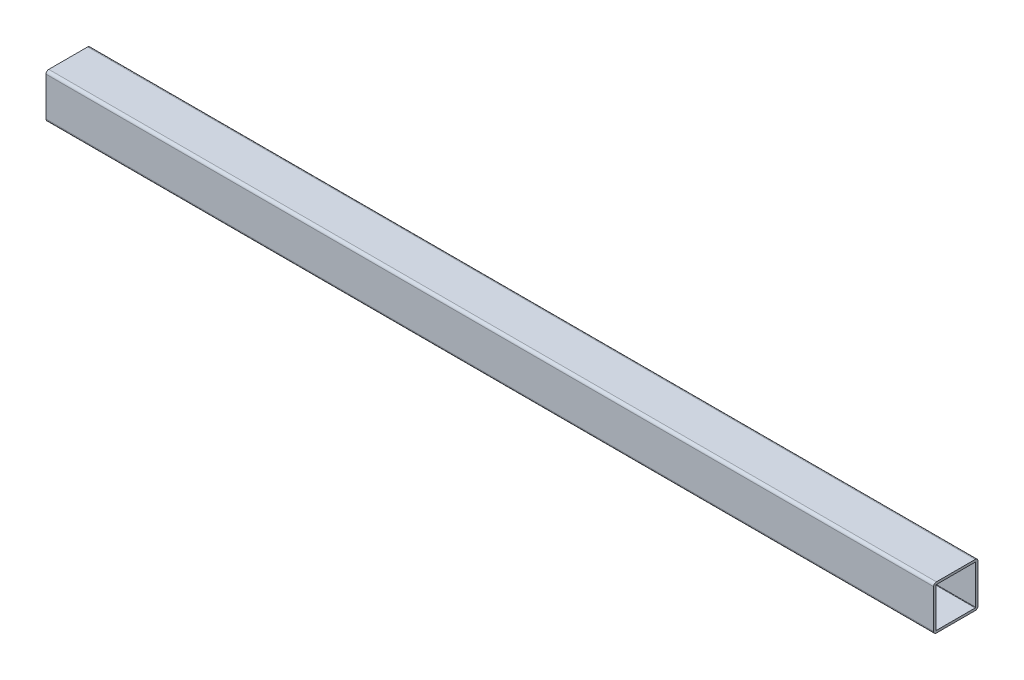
ISO-10303-21;
HEADER;
FILE_DESCRIPTION(('STEP AP214'),'2;1');
FILE_NAME('part.step','',(''),(''),'','','');
FILE_SCHEMA(('AUTOMOTIVE_DESIGN { 1 0 10303 214 1 1 1 1 }'));
ENDSEC;
DATA;
#1=APPLICATION_CONTEXT('core data for automotive mechanical design processes');
#2=APPLICATION_PROTOCOL_DEFINITION('international standard','automotive_design',2000,#1);
#3=PRODUCT_CONTEXT('',#1,'mechanical');
#4=PRODUCT('Part','Part','',(#3));
#5=PRODUCT_RELATED_PRODUCT_CATEGORY('part','',(#4));
#6=PRODUCT_DEFINITION_FORMATION('','',#4);
#7=PRODUCT_DEFINITION_CONTEXT('part definition',#1,'design');
#8=PRODUCT_DEFINITION('design','',#6,#7);
#9=PRODUCT_DEFINITION_SHAPE('','',#8);
#10=(LENGTH_UNIT() NAMED_UNIT(*) SI_UNIT(.MILLI.,.METRE.));
#11=(NAMED_UNIT(*) PLANE_ANGLE_UNIT() SI_UNIT($,.RADIAN.));
#12=(NAMED_UNIT(*) SI_UNIT($,.STERADIAN.) SOLID_ANGLE_UNIT());
#13=UNCERTAINTY_MEASURE_WITH_UNIT(LENGTH_MEASURE(1.E-05),#10,'distance_accuracy_value','');
#14=(GEOMETRIC_REPRESENTATION_CONTEXT(3) GLOBAL_UNCERTAINTY_ASSIGNED_CONTEXT((#13)) GLOBAL_UNIT_ASSIGNED_CONTEXT((#10,
#11,#12)) REPRESENTATION_CONTEXT('',''));
#15=CARTESIAN_POINT('',(0.,0.,0.));
#16=DIRECTION('',(0.,0.,1.));
#17=DIRECTION('',(1.,0.,0.));
#18=AXIS2_PLACEMENT_3D('',#15,#16,#17);
#19=CARTESIAN_POINT('',(508.,3.65674086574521,-16.8519621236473));
#20=DIRECTION('',(-1.,0.,0.));
#21=DIRECTION('',(0.,0.,1.));
#22=AXIS2_PLACEMENT_3D('',#19,#20,#21);
#23=PLANE('',#22);
#24=CARTESIAN_POINT('',(508.,3.65674086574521,-16.8519621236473));
#25=DIRECTION('',(1.,0.,0.));
#26=DIRECTION('',(0.,0.,1.));
#27=AXIS2_PLACEMENT_3D('',#24,#25,#26);
#28=CIRCLE('',#27,1.5875);
#29=CARTESIAN_POINT('',(508.,3.6567408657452,-18.4394621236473));
#30=VERTEX_POINT('',#29);
#31=CARTESIAN_POINT('',(508.,5.24424086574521,-16.8519621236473));
#32=VERTEX_POINT('',#31);
#33=EDGE_CURVE('E211',#30,#32,#28,.T.);
#34=ORIENTED_EDGE('',*,*,#33,.T.);
#35=DIRECTION('',(0.,0.,1.));
#36=VECTOR('',#35,1.);
#37=CARTESIAN_POINT('',(508.,5.24424086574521,5.37303787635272));
#38=LINE('',#37,#36);
#39=CARTESIAN_POINT('',(508.,5.24424086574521,5.37303787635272));
#40=VERTEX_POINT('',#39);
#41=EDGE_CURVE('E214',#32,#40,#38,.T.);
#42=ORIENTED_EDGE('',*,*,#41,.T.);
#43=CARTESIAN_POINT('',(508.,3.65674086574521,5.37303787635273));
#44=DIRECTION('',(1.,0.,0.));
#45=DIRECTION('',(0.,0.,1.));
#46=AXIS2_PLACEMENT_3D('',#43,#44,#45);
#47=CIRCLE('',#46,1.5875);
#48=CARTESIAN_POINT('',(508.,3.6567408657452,6.96053787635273));
#49=VERTEX_POINT('',#48);
#50=EDGE_CURVE('E217',#40,#49,#47,.T.);
#51=ORIENTED_EDGE('',*,*,#50,.T.);
#52=DIRECTION('',(0.,-1.,0.));
#53=VECTOR('',#52,1.);
#54=CARTESIAN_POINT('',(508.,3.6567408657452,6.96053787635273));
#55=LINE('',#54,#53);
#56=CARTESIAN_POINT('',(508.,-18.5682591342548,6.96053787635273));
#57=VERTEX_POINT('',#56);
#58=EDGE_CURVE('E219',#49,#57,#55,.T.);
#59=ORIENTED_EDGE('',*,*,#58,.T.);
#60=CARTESIAN_POINT('',(508.,-18.5682591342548,5.37303787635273));
#61=DIRECTION('',(1.,0.,0.));
#62=DIRECTION('',(0.,0.,1.));
#63=AXIS2_PLACEMENT_3D('',#60,#61,#62);
#64=CIRCLE('',#63,1.5875);
#65=CARTESIAN_POINT('',(508.,-20.1557591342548,5.37303787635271));
#66=VERTEX_POINT('',#65);
#67=EDGE_CURVE('E221',#57,#66,#64,.T.);
#68=ORIENTED_EDGE('',*,*,#67,.T.);
#69=DIRECTION('',(0.,0.,-1.));
#70=VECTOR('',#69,1.);
#71=CARTESIAN_POINT('',(508.,-20.1557591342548,5.37303787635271));
#72=LINE('',#71,#70);
#73=CARTESIAN_POINT('',(508.,-20.1557591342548,-16.8519621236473));
#74=VERTEX_POINT('',#73);
#75=EDGE_CURVE('E223',#66,#74,#72,.T.);
#76=ORIENTED_EDGE('',*,*,#75,.T.);
#77=CARTESIAN_POINT('',(508.,-18.5682591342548,-16.8519621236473));
#78=DIRECTION('',(1.,0.,0.));
#79=DIRECTION('',(0.,0.,1.));
#80=AXIS2_PLACEMENT_3D('',#77,#78,#79);
#81=CIRCLE('',#80,1.5875);
#82=CARTESIAN_POINT('',(508.,-18.5682591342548,-18.4394621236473));
#83=VERTEX_POINT('',#82);
#84=EDGE_CURVE('E225',#74,#83,#81,.T.);
#85=ORIENTED_EDGE('',*,*,#84,.T.);
#86=DIRECTION('',(0.,1.,0.));
#87=VECTOR('',#86,1.);
#88=CARTESIAN_POINT('',(508.,3.6567408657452,-18.4394621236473));
#89=LINE('',#88,#87);
#90=EDGE_CURVE('E227',#83,#30,#89,.T.);
#91=ORIENTED_EDGE('',*,*,#90,.T.);
#92=EDGE_LOOP('',(#34,#42,#51,#59,#68,#76,#85,#91));
#93=FACE_BOUND('',#92,.T.);
#94=CARTESIAN_POINT('',(508.,3.65674086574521,5.37303787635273));
#95=DIRECTION('',(1.,0.,0.));
#96=DIRECTION('',(0.,0.,1.));
#97=AXIS2_PLACEMENT_3D('',#94,#95,#96);
#98=CIRCLE('',#97,0.2413);
#99=CARTESIAN_POINT('',(508.,3.89804086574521,5.37303787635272));
#100=VERTEX_POINT('',#99);
#101=CARTESIAN_POINT('',(508.,3.6567408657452,5.61433787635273));
#102=VERTEX_POINT('',#101);
#103=EDGE_CURVE('E146',#100,#102,#98,.T.);
#104=ORIENTED_EDGE('',*,*,#103,.F.);
#105=DIRECTION('',(0.,0.,1.));
#106=VECTOR('',#105,1.);
#107=CARTESIAN_POINT('',(508.,3.89804086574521,5.37303787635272));
#108=LINE('',#107,#106);
#109=CARTESIAN_POINT('',(508.,3.89804086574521,-16.8519621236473));
#110=VERTEX_POINT('',#109);
#111=EDGE_CURVE('E179',#110,#100,#108,.T.);
#112=ORIENTED_EDGE('',*,*,#111,.F.);
#113=CARTESIAN_POINT('',(508.,3.65674086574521,-16.8519621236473));
#114=DIRECTION('',(1.,0.,0.));
#115=DIRECTION('',(0.,0.,1.));
#116=AXIS2_PLACEMENT_3D('',#113,#114,#115);
#117=CIRCLE('',#116,0.2413);
#118=CARTESIAN_POINT('',(508.,3.65674086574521,-17.0932621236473));
#119=VERTEX_POINT('',#118);
#120=EDGE_CURVE('E177',#119,#110,#117,.T.);
#121=ORIENTED_EDGE('',*,*,#120,.F.);
#122=DIRECTION('',(0.,1.,0.));
#123=VECTOR('',#122,1.);
#124=CARTESIAN_POINT('',(508.,3.65674086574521,-17.0932621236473));
#125=LINE('',#124,#123);
#126=CARTESIAN_POINT('',(508.,-18.5682591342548,-17.0932621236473));
#127=VERTEX_POINT('',#126);
#128=EDGE_CURVE('E175',#127,#119,#125,.T.);
#129=ORIENTED_EDGE('',*,*,#128,.F.);
#130=CARTESIAN_POINT('',(508.,-18.5682591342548,-16.8519621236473));
#131=DIRECTION('',(1.,0.,0.));
#132=DIRECTION('',(0.,0.,1.));
#133=AXIS2_PLACEMENT_3D('',#130,#131,#132);
#134=CIRCLE('',#133,0.241299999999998);
#135=CARTESIAN_POINT('',(508.,-18.8095591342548,-16.8519621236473));
#136=VERTEX_POINT('',#135);
#137=EDGE_CURVE('E173',#136,#127,#134,.T.);
#138=ORIENTED_EDGE('',*,*,#137,.F.);
#139=DIRECTION('',(0.,0.,-1.));
#140=VECTOR('',#139,1.);
#141=CARTESIAN_POINT('',(508.,-18.8095591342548,5.37303787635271));
#142=LINE('',#141,#140);
#143=CARTESIAN_POINT('',(508.,-18.8095591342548,5.37303787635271));
#144=VERTEX_POINT('',#143);
#145=EDGE_CURVE('E169',#144,#136,#142,.T.);
#146=ORIENTED_EDGE('',*,*,#145,.F.);
#147=CARTESIAN_POINT('',(508.,-18.5682591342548,5.37303787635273));
#148=DIRECTION('',(1.,0.,0.));
#149=DIRECTION('',(0.,0.,1.));
#150=AXIS2_PLACEMENT_3D('',#147,#148,#149);
#151=CIRCLE('',#150,0.241299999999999);
#152=CARTESIAN_POINT('',(508.,-18.5682591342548,5.61433787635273));
#153=VERTEX_POINT('',#152);
#154=EDGE_CURVE('E167',#153,#144,#151,.T.);
#155=ORIENTED_EDGE('',*,*,#154,.F.);
#156=DIRECTION('',(0.,-1.,0.));
#157=VECTOR('',#156,1.);
#158=CARTESIAN_POINT('',(508.,3.6567408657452,5.61433787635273));
#159=LINE('',#158,#157);
#160=EDGE_CURVE('E154',#102,#153,#159,.T.);
#161=ORIENTED_EDGE('',*,*,#160,.F.);
#162=EDGE_LOOP('',(#104,#112,#121,#129,#138,#146,#155,#161));
#163=FACE_BOUND('',#162,.T.);
#164=ADVANCED_FACE('F33',(#93,#163),#23,.F.);
#165=CARTESIAN_POINT('',(0.,3.65674086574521,-16.8519621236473));
#166=DIRECTION('',(-1.,0.,0.));
#167=DIRECTION('',(0.,0.,1.));
#168=AXIS2_PLACEMENT_3D('',#165,#166,#167);
#169=PLANE('',#168);
#170=CARTESIAN_POINT('',(0.,3.65674086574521,-16.8519621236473));
#171=DIRECTION('',(1.,0.,0.));
#172=DIRECTION('',(0.,0.,1.));
#173=AXIS2_PLACEMENT_3D('',#170,#171,#172);
#174=CIRCLE('',#173,1.5875);
#175=CARTESIAN_POINT('',(0.,3.6567408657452,-18.4394621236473));
#176=VERTEX_POINT('',#175);
#177=CARTESIAN_POINT('',(0.,5.24424086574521,-16.8519621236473));
#178=VERTEX_POINT('',#177);
#179=EDGE_CURVE('E162',#176,#178,#174,.T.);
#180=ORIENTED_EDGE('',*,*,#179,.F.);
#181=DIRECTION('',(0.,1.,0.));
#182=VECTOR('',#181,1.);
#183=CARTESIAN_POINT('',(0.,3.6567408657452,-18.4394621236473));
#184=LINE('',#183,#182);
#185=CARTESIAN_POINT('',(0.,-18.5682591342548,-18.4394621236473));
#186=VERTEX_POINT('',#185);
#187=EDGE_CURVE('E215',#186,#176,#184,.T.);
#188=ORIENTED_EDGE('',*,*,#187,.F.);
#189=CARTESIAN_POINT('',(0.,-18.5682591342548,-16.8519621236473));
#190=DIRECTION('',(1.,0.,0.));
#191=DIRECTION('',(0.,0.,1.));
#192=AXIS2_PLACEMENT_3D('',#189,#190,#191);
#193=CIRCLE('',#192,1.5875);
#194=CARTESIAN_POINT('',(0.,-20.1557591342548,-16.8519621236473));
#195=VERTEX_POINT('',#194);
#196=EDGE_CURVE('E242',#195,#186,#193,.T.);
#197=ORIENTED_EDGE('',*,*,#196,.F.);
#198=DIRECTION('',(0.,0.,-1.));
#199=VECTOR('',#198,1.);
#200=CARTESIAN_POINT('',(0.,-20.1557591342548,5.37303787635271));
#201=LINE('',#200,#199);
#202=CARTESIAN_POINT('',(0.,-20.1557591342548,5.37303787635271));
#203=VERTEX_POINT('',#202);
#204=EDGE_CURVE('E240',#203,#195,#201,.T.);
#205=ORIENTED_EDGE('',*,*,#204,.F.);
#206=CARTESIAN_POINT('',(0.,-18.5682591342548,5.37303787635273));
#207=DIRECTION('',(1.,0.,0.));
#208=DIRECTION('',(0.,0.,1.));
#209=AXIS2_PLACEMENT_3D('',#206,#207,#208);
#210=CIRCLE('',#209,1.5875);
#211=CARTESIAN_POINT('',(0.,-18.5682591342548,6.96053787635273));
#212=VERTEX_POINT('',#211);
#213=EDGE_CURVE('E238',#212,#203,#210,.T.);
#214=ORIENTED_EDGE('',*,*,#213,.F.);
#215=DIRECTION('',(0.,-1.,0.));
#216=VECTOR('',#215,1.);
#217=CARTESIAN_POINT('',(0.,3.6567408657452,6.96053787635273));
#218=LINE('',#217,#216);
#219=CARTESIAN_POINT('',(0.,3.6567408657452,6.96053787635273));
#220=VERTEX_POINT('',#219);
#221=EDGE_CURVE('E236',#220,#212,#218,.T.);
#222=ORIENTED_EDGE('',*,*,#221,.F.);
#223=CARTESIAN_POINT('',(0.,3.65674086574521,5.37303787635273));
#224=DIRECTION('',(1.,0.,0.));
#225=DIRECTION('',(0.,0.,1.));
#226=AXIS2_PLACEMENT_3D('',#223,#224,#225);
#227=CIRCLE('',#226,1.5875);
#228=CARTESIAN_POINT('',(0.,5.24424086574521,5.37303787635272));
#229=VERTEX_POINT('',#228);
#230=EDGE_CURVE('E234',#229,#220,#227,.T.);
#231=ORIENTED_EDGE('',*,*,#230,.F.);
#232=DIRECTION('',(0.,0.,1.));
#233=VECTOR('',#232,1.);
#234=CARTESIAN_POINT('',(0.,5.24424086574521,5.37303787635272));
#235=LINE('',#234,#233);
#236=EDGE_CURVE('E232',#178,#229,#235,.T.);
#237=ORIENTED_EDGE('',*,*,#236,.F.);
#238=EDGE_LOOP('',(#180,#188,#197,#205,#214,#222,#231,#237));
#239=FACE_BOUND('',#238,.T.);
#240=DIRECTION('',(0.,0.,1.));
#241=VECTOR('',#240,1.);
#242=CARTESIAN_POINT('',(0.,3.89804086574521,5.37303787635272));
#243=LINE('',#242,#241);
#244=CARTESIAN_POINT('',(0.,3.89804086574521,-16.8519621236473));
#245=VERTEX_POINT('',#244);
#246=CARTESIAN_POINT('',(0.,3.89804086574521,5.37303787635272));
#247=VERTEX_POINT('',#246);
#248=EDGE_CURVE('E155',#245,#247,#243,.T.);
#249=ORIENTED_EDGE('',*,*,#248,.T.);
#250=CARTESIAN_POINT('',(0.,3.65674086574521,5.37303787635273));
#251=DIRECTION('',(1.,0.,0.));
#252=DIRECTION('',(0.,0.,1.));
#253=AXIS2_PLACEMENT_3D('',#250,#251,#252);
#254=CIRCLE('',#253,0.2413);
#255=CARTESIAN_POINT('',(0.,3.6567408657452,5.61433787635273));
#256=VERTEX_POINT('',#255);
#257=EDGE_CURVE('E56',#247,#256,#254,.T.);
#258=ORIENTED_EDGE('',*,*,#257,.T.);
#259=DIRECTION('',(0.,-1.,0.));
#260=VECTOR('',#259,1.);
#261=CARTESIAN_POINT('',(0.,3.6567408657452,5.61433787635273));
#262=LINE('',#261,#260);
#263=CARTESIAN_POINT('',(0.,-18.5682591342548,5.61433787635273));
#264=VERTEX_POINT('',#263);
#265=EDGE_CURVE('E161',#256,#264,#262,.T.);
#266=ORIENTED_EDGE('',*,*,#265,.T.);
#267=CARTESIAN_POINT('',(0.,-18.5682591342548,5.37303787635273));
#268=DIRECTION('',(1.,0.,0.));
#269=DIRECTION('',(0.,0.,1.));
#270=AXIS2_PLACEMENT_3D('',#267,#268,#269);
#271=CIRCLE('',#270,0.241299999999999);
#272=CARTESIAN_POINT('',(0.,-18.8095591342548,5.37303787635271));
#273=VERTEX_POINT('',#272);
#274=EDGE_CURVE('E183',#264,#273,#271,.T.);
#275=ORIENTED_EDGE('',*,*,#274,.T.);
#276=DIRECTION('',(0.,0.,-1.));
#277=VECTOR('',#276,1.);
#278=CARTESIAN_POINT('',(0.,-18.8095591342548,5.37303787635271));
#279=LINE('',#278,#277);
#280=CARTESIAN_POINT('',(0.,-18.8095591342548,-16.8519621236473));
#281=VERTEX_POINT('',#280);
#282=EDGE_CURVE('E186',#273,#281,#279,.T.);
#283=ORIENTED_EDGE('',*,*,#282,.T.);
#284=CARTESIAN_POINT('',(0.,-18.5682591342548,-16.8519621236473));
#285=DIRECTION('',(1.,0.,0.));
#286=DIRECTION('',(0.,0.,1.));
#287=AXIS2_PLACEMENT_3D('',#284,#285,#286);
#288=CIRCLE('',#287,0.241299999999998);
#289=CARTESIAN_POINT('',(0.,-18.5682591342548,-17.0932621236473));
#290=VERTEX_POINT('',#289);
#291=EDGE_CURVE('E189',#281,#290,#288,.T.);
#292=ORIENTED_EDGE('',*,*,#291,.T.);
#293=DIRECTION('',(0.,1.,0.));
#294=VECTOR('',#293,1.);
#295=CARTESIAN_POINT('',(0.,3.65674086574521,-17.0932621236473));
#296=LINE('',#295,#294);
#297=CARTESIAN_POINT('',(0.,3.65674086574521,-17.0932621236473));
#298=VERTEX_POINT('',#297);
#299=EDGE_CURVE('E192',#290,#298,#296,.T.);
#300=ORIENTED_EDGE('',*,*,#299,.T.);
#301=CARTESIAN_POINT('',(0.,3.65674086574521,-16.8519621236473));
#302=DIRECTION('',(1.,0.,0.));
#303=DIRECTION('',(0.,0.,1.));
#304=AXIS2_PLACEMENT_3D('',#301,#302,#303);
#305=CIRCLE('',#304,0.2413);
#306=EDGE_CURVE('E195',#298,#245,#305,.T.);
#307=ORIENTED_EDGE('',*,*,#306,.T.);
#308=EDGE_LOOP('',(#249,#258,#266,#275,#283,#292,#300,#307));
#309=FACE_BOUND('',#308,.T.);
#310=ADVANCED_FACE('F272',(#239,#309),#169,.T.);
#311=CARTESIAN_POINT('',(508.,3.65674086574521,-16.8519621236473));
#312=DIRECTION('',(-1.,0.,0.));
#313=DIRECTION('',(0.,0.,1.));
#314=AXIS2_PLACEMENT_3D('',#311,#312,#313);
#315=CYLINDRICAL_SURFACE('',#314,1.5875);
#316=ORIENTED_EDGE('',*,*,#179,.T.);
#317=DIRECTION('',(-1.,0.,0.));
#318=VECTOR('',#317,1.);
#319=CARTESIAN_POINT('',(508.,5.24424086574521,-16.8519621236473));
#320=LINE('',#319,#318);
#321=EDGE_CURVE('E11',#32,#178,#320,.T.);
#322=ORIENTED_EDGE('',*,*,#321,.F.);
#323=ORIENTED_EDGE('',*,*,#33,.F.);
#324=DIRECTION('',(-1.,0.,0.));
#325=VECTOR('',#324,1.);
#326=CARTESIAN_POINT('',(508.,3.6567408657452,-18.4394621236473));
#327=LINE('',#326,#325);
#328=EDGE_CURVE('E229',#30,#176,#327,.T.);
#329=ORIENTED_EDGE('',*,*,#328,.T.);
#330=EDGE_LOOP('',(#316,#322,#323,#329));
#331=FACE_BOUND('',#330,.T.);
#332=ADVANCED_FACE('F35',(#331),#315,.T.);
#333=CARTESIAN_POINT('',(508.,5.24424086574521,5.37303787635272));
#334=DIRECTION('',(0.,-1.,0.));
#335=DIRECTION('',(0.,0.,-1.));
#336=AXIS2_PLACEMENT_3D('',#333,#334,#335);
#337=PLANE('',#336);
#338=ORIENTED_EDGE('',*,*,#236,.T.);
#339=DIRECTION('',(-1.,0.,0.));
#340=VECTOR('',#339,1.);
#341=CARTESIAN_POINT('',(508.,5.24424086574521,5.37303787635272));
#342=LINE('',#341,#340);
#343=EDGE_CURVE('E41',#40,#229,#342,.T.);
#344=ORIENTED_EDGE('',*,*,#343,.F.);
#345=ORIENTED_EDGE('',*,*,#41,.F.);
#346=ORIENTED_EDGE('',*,*,#321,.T.);
#347=EDGE_LOOP('',(#338,#344,#345,#346));
#348=FACE_BOUND('',#347,.T.);
#349=ADVANCED_FACE('F289',(#348),#337,.F.);
#350=CARTESIAN_POINT('',(508.,3.65674086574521,5.37303787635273));
#351=DIRECTION('',(-1.,0.,0.));
#352=DIRECTION('',(0.,0.,1.));
#353=AXIS2_PLACEMENT_3D('',#350,#351,#352);
#354=CYLINDRICAL_SURFACE('',#353,1.5875);
#355=ORIENTED_EDGE('',*,*,#230,.T.);
#356=DIRECTION('',(-1.,0.,0.));
#357=VECTOR('',#356,1.);
#358=CARTESIAN_POINT('',(508.,3.6567408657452,6.96053787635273));
#359=LINE('',#358,#357);
#360=EDGE_CURVE('E259',#49,#220,#359,.T.);
#361=ORIENTED_EDGE('',*,*,#360,.F.);
#362=ORIENTED_EDGE('',*,*,#50,.F.);
#363=ORIENTED_EDGE('',*,*,#343,.T.);
#364=EDGE_LOOP('',(#355,#361,#362,#363));
#365=FACE_BOUND('',#364,.T.);
#366=ADVANCED_FACE('F266',(#365),#354,.T.);
#367=CARTESIAN_POINT('',(508.,3.6567408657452,6.96053787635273));
#368=DIRECTION('',(0.,0.,-1.));
#369=DIRECTION('',(0.,1.,0.));
#370=AXIS2_PLACEMENT_3D('',#367,#368,#369);
#371=PLANE('',#370);
#372=ORIENTED_EDGE('',*,*,#221,.T.);
#373=DIRECTION('',(-1.,0.,0.));
#374=VECTOR('',#373,1.);
#375=CARTESIAN_POINT('',(508.,-18.5682591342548,6.96053787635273));
#376=LINE('',#375,#374);
#377=EDGE_CURVE('E256',#57,#212,#376,.T.);
#378=ORIENTED_EDGE('',*,*,#377,.F.);
#379=ORIENTED_EDGE('',*,*,#58,.F.);
#380=ORIENTED_EDGE('',*,*,#360,.T.);
#381=EDGE_LOOP('',(#372,#378,#379,#380));
#382=FACE_BOUND('',#381,.T.);
#383=ADVANCED_FACE('F278',(#382),#371,.F.);
#384=CARTESIAN_POINT('',(508.,-18.5682591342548,5.37303787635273));
#385=DIRECTION('',(-1.,0.,0.));
#386=DIRECTION('',(0.,0.,1.));
#387=AXIS2_PLACEMENT_3D('',#384,#385,#386);
#388=CYLINDRICAL_SURFACE('',#387,1.5875);
#389=ORIENTED_EDGE('',*,*,#213,.T.);
#390=DIRECTION('',(-1.,0.,0.));
#391=VECTOR('',#390,1.);
#392=CARTESIAN_POINT('',(508.,-20.1557591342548,5.37303787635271));
#393=LINE('',#392,#391);
#394=EDGE_CURVE('E253',#66,#203,#393,.T.);
#395=ORIENTED_EDGE('',*,*,#394,.F.);
#396=ORIENTED_EDGE('',*,*,#67,.F.);
#397=ORIENTED_EDGE('',*,*,#377,.T.);
#398=EDGE_LOOP('',(#389,#395,#396,#397));
#399=FACE_BOUND('',#398,.T.);
#400=ADVANCED_FACE('F282',(#399),#388,.T.);
#401=CARTESIAN_POINT('',(508.,-20.1557591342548,5.37303787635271));
#402=DIRECTION('',(0.,1.,0.));
#403=DIRECTION('',(0.,0.,1.));
#404=AXIS2_PLACEMENT_3D('',#401,#402,#403);
#405=PLANE('',#404);
#406=ORIENTED_EDGE('',*,*,#204,.T.);
#407=DIRECTION('',(-1.,0.,0.));
#408=VECTOR('',#407,1.);
#409=CARTESIAN_POINT('',(508.,-20.1557591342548,-16.8519621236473));
#410=LINE('',#409,#408);
#411=EDGE_CURVE('E250',#74,#195,#410,.T.);
#412=ORIENTED_EDGE('',*,*,#411,.F.);
#413=ORIENTED_EDGE('',*,*,#75,.F.);
#414=ORIENTED_EDGE('',*,*,#394,.T.);
#415=EDGE_LOOP('',(#406,#412,#413,#414));
#416=FACE_BOUND('',#415,.T.);
#417=ADVANCED_FACE('F302',(#416),#405,.F.);
#418=CARTESIAN_POINT('',(508.,-18.5682591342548,-16.8519621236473));
#419=DIRECTION('',(-1.,0.,0.));
#420=DIRECTION('',(0.,0.,1.));
#421=AXIS2_PLACEMENT_3D('',#418,#419,#420);
#422=CYLINDRICAL_SURFACE('',#421,1.5875);
#423=ORIENTED_EDGE('',*,*,#196,.T.);
#424=DIRECTION('',(-1.,0.,0.));
#425=VECTOR('',#424,1.);
#426=CARTESIAN_POINT('',(508.,-18.5682591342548,-18.4394621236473));
#427=LINE('',#426,#425);
#428=EDGE_CURVE('E247',#83,#186,#427,.T.);
#429=ORIENTED_EDGE('',*,*,#428,.F.);
#430=ORIENTED_EDGE('',*,*,#84,.F.);
#431=ORIENTED_EDGE('',*,*,#411,.T.);
#432=EDGE_LOOP('',(#423,#429,#430,#431));
#433=FACE_BOUND('',#432,.T.);
#434=ADVANCED_FACE('F300',(#433),#422,.T.);
#435=CARTESIAN_POINT('',(508.,3.6567408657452,-18.4394621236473));
#436=DIRECTION('',(0.,0.,1.));
#437=DIRECTION('',(0.,-1.,0.));
#438=AXIS2_PLACEMENT_3D('',#435,#436,#437);
#439=PLANE('',#438);
#440=ORIENTED_EDGE('',*,*,#187,.T.);
#441=ORIENTED_EDGE('',*,*,#328,.F.);
#442=ORIENTED_EDGE('',*,*,#90,.F.);
#443=ORIENTED_EDGE('',*,*,#428,.T.);
#444=EDGE_LOOP('',(#440,#441,#442,#443));
#445=FACE_BOUND('',#444,.T.);
#446=ADVANCED_FACE('F295',(#445),#439,.F.);
#447=CARTESIAN_POINT('',(508.,3.65674086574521,5.37303787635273));
#448=DIRECTION('',(-1.,0.,0.));
#449=DIRECTION('',(0.,0.,1.));
#450=AXIS2_PLACEMENT_3D('',#447,#448,#449);
#451=CYLINDRICAL_SURFACE('',#450,0.2413);
#452=ORIENTED_EDGE('',*,*,#257,.F.);
#453=DIRECTION('',(-1.,0.,0.));
#454=VECTOR('',#453,1.);
#455=CARTESIAN_POINT('',(508.,3.89804086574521,5.37303787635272));
#456=LINE('',#455,#454);
#457=EDGE_CURVE('E150',#100,#247,#456,.T.);
#458=ORIENTED_EDGE('',*,*,#457,.F.);
#459=ORIENTED_EDGE('',*,*,#103,.T.);
#460=DIRECTION('',(-1.,0.,0.));
#461=VECTOR('',#460,1.);
#462=CARTESIAN_POINT('',(508.,3.6567408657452,5.61433787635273));
#463=LINE('',#462,#461);
#464=EDGE_CURVE('E149',#102,#256,#463,.T.);
#465=ORIENTED_EDGE('',*,*,#464,.T.);
#466=EDGE_LOOP('',(#452,#458,#459,#465));
#467=FACE_BOUND('',#466,.T.);
#468=ADVANCED_FACE('F148',(#467),#451,.F.);
#469=CARTESIAN_POINT('',(508.,3.6567408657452,5.61433787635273));
#470=DIRECTION('',(0.,0.,-1.));
#471=DIRECTION('',(0.,1.,0.));
#472=AXIS2_PLACEMENT_3D('',#469,#470,#471);
#473=PLANE('',#472);
#474=ORIENTED_EDGE('',*,*,#265,.F.);
#475=ORIENTED_EDGE('',*,*,#464,.F.);
#476=ORIENTED_EDGE('',*,*,#160,.T.);
#477=DIRECTION('',(-1.,0.,0.));
#478=VECTOR('',#477,1.);
#479=CARTESIAN_POINT('',(508.,-18.5682591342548,5.61433787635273));
#480=LINE('',#479,#478);
#481=EDGE_CURVE('E163',#153,#264,#480,.T.);
#482=ORIENTED_EDGE('',*,*,#481,.T.);
#483=EDGE_LOOP('',(#474,#475,#476,#482));
#484=FACE_BOUND('',#483,.T.);
#485=ADVANCED_FACE('F158',(#484),#473,.T.);
#486=CARTESIAN_POINT('',(508.,-18.5682591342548,5.37303787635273));
#487=DIRECTION('',(-1.,0.,0.));
#488=DIRECTION('',(0.,0.,1.));
#489=AXIS2_PLACEMENT_3D('',#486,#487,#488);
#490=CYLINDRICAL_SURFACE('',#489,0.241299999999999);
#491=ORIENTED_EDGE('',*,*,#274,.F.);
#492=ORIENTED_EDGE('',*,*,#481,.F.);
#493=ORIENTED_EDGE('',*,*,#154,.T.);
#494=DIRECTION('',(-1.,0.,0.));
#495=VECTOR('',#494,1.);
#496=CARTESIAN_POINT('',(508.,-18.8095591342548,5.37303787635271));
#497=LINE('',#496,#495);
#498=EDGE_CURVE('E208',#144,#273,#497,.T.);
#499=ORIENTED_EDGE('',*,*,#498,.T.);
#500=EDGE_LOOP('',(#491,#492,#493,#499));
#501=FACE_BOUND('',#500,.T.);
#502=ADVANCED_FACE('F327',(#501),#490,.F.);
#503=CARTESIAN_POINT('',(508.,-18.8095591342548,5.37303787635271));
#504=DIRECTION('',(0.,1.,0.));
#505=DIRECTION('',(0.,0.,1.));
#506=AXIS2_PLACEMENT_3D('',#503,#504,#505);
#507=PLANE('',#506);
#508=ORIENTED_EDGE('',*,*,#282,.F.);
#509=ORIENTED_EDGE('',*,*,#498,.F.);
#510=ORIENTED_EDGE('',*,*,#145,.T.);
#511=DIRECTION('',(-1.,0.,0.));
#512=VECTOR('',#511,1.);
#513=CARTESIAN_POINT('',(508.,-18.8095591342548,-16.8519621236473));
#514=LINE('',#513,#512);
#515=EDGE_CURVE('E206',#136,#281,#514,.T.);
#516=ORIENTED_EDGE('',*,*,#515,.T.);
#517=EDGE_LOOP('',(#508,#509,#510,#516));
#518=FACE_BOUND('',#517,.T.);
#519=ADVANCED_FACE('F331',(#518),#507,.T.);
#520=CARTESIAN_POINT('',(508.,-18.5682591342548,-16.8519621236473));
#521=DIRECTION('',(-1.,0.,0.));
#522=DIRECTION('',(0.,0.,1.));
#523=AXIS2_PLACEMENT_3D('',#520,#521,#522);
#524=CYLINDRICAL_SURFACE('',#523,0.241299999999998);
#525=ORIENTED_EDGE('',*,*,#291,.F.);
#526=ORIENTED_EDGE('',*,*,#515,.F.);
#527=ORIENTED_EDGE('',*,*,#137,.T.);
#528=DIRECTION('',(-1.,0.,0.));
#529=VECTOR('',#528,1.);
#530=CARTESIAN_POINT('',(508.,-18.5682591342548,-17.0932621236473));
#531=LINE('',#530,#529);
#532=EDGE_CURVE('E204',#127,#290,#531,.T.);
#533=ORIENTED_EDGE('',*,*,#532,.T.);
#534=EDGE_LOOP('',(#525,#526,#527,#533));
#535=FACE_BOUND('',#534,.T.);
#536=ADVANCED_FACE('F337',(#535),#524,.F.);
#537=CARTESIAN_POINT('',(508.,3.65674086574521,-17.0932621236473));
#538=DIRECTION('',(0.,0.,1.));
#539=DIRECTION('',(1.,0.,0.));
#540=AXIS2_PLACEMENT_3D('',#537,#538,#539);
#541=PLANE('',#540);
#542=ORIENTED_EDGE('',*,*,#299,.F.);
#543=ORIENTED_EDGE('',*,*,#532,.F.);
#544=ORIENTED_EDGE('',*,*,#128,.T.);
#545=DIRECTION('',(-1.,0.,0.));
#546=VECTOR('',#545,1.);
#547=CARTESIAN_POINT('',(508.,3.65674086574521,-17.0932621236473));
#548=LINE('',#547,#546);
#549=EDGE_CURVE('E202',#119,#298,#548,.T.);
#550=ORIENTED_EDGE('',*,*,#549,.T.);
#551=EDGE_LOOP('',(#542,#543,#544,#550));
#552=FACE_BOUND('',#551,.T.);
#553=ADVANCED_FACE('F341',(#552),#541,.T.);
#554=CARTESIAN_POINT('',(508.,3.65674086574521,-16.8519621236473));
#555=DIRECTION('',(-1.,0.,0.));
#556=DIRECTION('',(0.,0.,1.));
#557=AXIS2_PLACEMENT_3D('',#554,#555,#556);
#558=CYLINDRICAL_SURFACE('',#557,0.2413);
#559=ORIENTED_EDGE('',*,*,#306,.F.);
#560=ORIENTED_EDGE('',*,*,#549,.F.);
#561=ORIENTED_EDGE('',*,*,#120,.T.);
#562=DIRECTION('',(-1.,0.,0.));
#563=VECTOR('',#562,1.);
#564=CARTESIAN_POINT('',(508.,3.89804086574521,-16.8519621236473));
#565=LINE('',#564,#563);
#566=EDGE_CURVE('E48',#110,#245,#565,.T.);
#567=ORIENTED_EDGE('',*,*,#566,.T.);
#568=EDGE_LOOP('',(#559,#560,#561,#567));
#569=FACE_BOUND('',#568,.T.);
#570=ADVANCED_FACE('F345',(#569),#558,.F.);
#571=CARTESIAN_POINT('',(508.,3.89804086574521,5.37303787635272));
#572=DIRECTION('',(0.,-1.,0.));
#573=DIRECTION('',(0.,0.,-1.));
#574=AXIS2_PLACEMENT_3D('',#571,#572,#573);
#575=PLANE('',#574);
#576=ORIENTED_EDGE('',*,*,#248,.F.);
#577=ORIENTED_EDGE('',*,*,#566,.F.);
#578=ORIENTED_EDGE('',*,*,#111,.T.);
#579=ORIENTED_EDGE('',*,*,#457,.T.);
#580=EDGE_LOOP('',(#576,#577,#578,#579));
#581=FACE_BOUND('',#580,.T.);
#582=ADVANCED_FACE('F349',(#581),#575,.T.);
#583=CLOSED_SHELL('',(#164,#310,#332,#349,#366,#383,#400,#417,#434,#446,#468,#485,#502,#519,
#536,#553,#570,#582));
#584=MANIFOLD_SOLID_BREP('B2',#583);
#585=ADVANCED_BREP_SHAPE_REPRESENTATION('',(#18,#584),#14);
#586=SHAPE_DEFINITION_REPRESENTATION(#9,#585);
ENDSEC;
END-ISO-10303-21;
